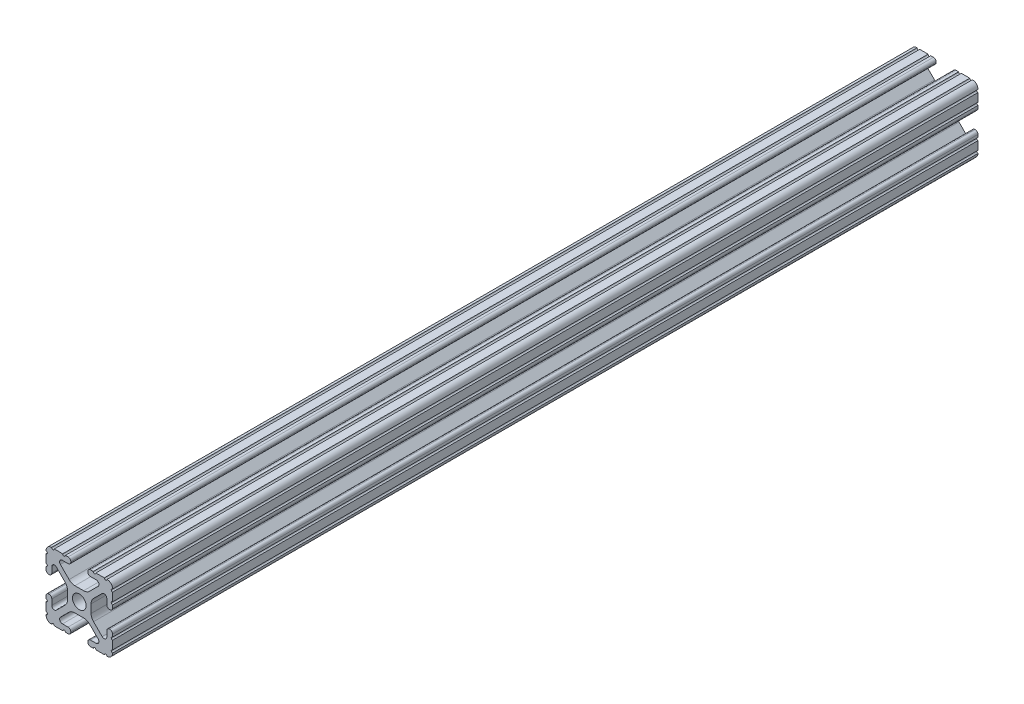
from build123d import *

# Parameters (mm, degrees)
SKETCH1_R           = 2.6035
BOSS_EXTRUDE1_DEPTH = 165.1


with BuildPart() as part:
    # Sketch1 → Boss-Extrude1 (new, symmetric)
    with BuildSketch(Plane.XY):
        with BuildLine():
            Line((-7.179650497, -8.645192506), (-3.952270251, -5.423690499))
            ThreePointArc((-3.952270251, -5.423690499), (-2.922936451, -4.736929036), (-1.709253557, -4.4958))
            Line((-1.709253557, -4.4958), (1.709253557, -4.4958))
            ThreePointArc((1.709253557, -4.4958), (2.922936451, -4.736929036), (3.952270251, -5.423690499))
            Line((3.952270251, -5.423690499), (7.179650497, -8.645192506))
            ThreePointArc((7.179650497, -8.645192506), (7.41473083, -9.822813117), (6.416408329, -10.4902))
            Line((6.416408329, -10.4902), (4.287512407, -10.4902))
            ThreePointArc((4.287512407, -10.4902), (3.54574862, -10.79744862), (3.2385, -11.539212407))
            Line((3.2385, -11.539212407), (3.2385, -11.650987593))
            ThreePointArc((3.2385, -11.650987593), (3.54574862, -12.39275138), (4.287512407, -12.7))
            Line((4.287512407, -12.7), (5.317126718, -12.7))
            ThreePointArc((5.317126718, -12.7), (5.825126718, -12.192), (6.333126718, -12.7))
            Line((6.333126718, -12.7), (9.550443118, -12.7))
            ThreePointArc((9.550443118, -12.7), (10.058366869, -12.192000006), (10.566443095, -12.699847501))
            ThreePointArc((10.566443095, -12.699847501), (12.082537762, -12.08250727), (12.699846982, -10.566399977))
            ThreePointArc((12.699846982, -10.566399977), (12.192000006, -10.058323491), (12.7, -9.5504))
            Line((12.7, -9.5504), (12.7, -6.3330836))
            ThreePointArc((12.7, -6.3330836), (12.192, -5.8250836), (12.7, -5.3170836))
            Line((12.7, -5.3170836), (12.7, -4.287469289))
            ThreePointArc((12.7, -4.287469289), (12.39275138, -3.545705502), (11.650987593, -3.238456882))
            Line((11.650987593, -3.238456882), (11.539212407, -3.238456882))
            ThreePointArc((11.539212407, -3.238456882), (10.79744862, -3.545705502), (10.4902, -4.287469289))
            Line((10.4902, -4.287469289), (10.4902, -6.402089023))
            ThreePointArc((10.4902, -6.402089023), (9.856505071, -7.351067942), (8.737131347, -7.129408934))
            Line((8.737131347, -7.129408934), (5.441005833, -3.840816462))
            ThreePointArc((5.441005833, -3.840816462), (4.750877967, -2.809883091), (4.5085, -1.593185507))
            Line((4.5085, -1.593185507), (4.5085, 1.593185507))
            ThreePointArc((4.5085, 1.593185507), (4.750877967, 2.809883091), (5.441005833, 3.840816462))
            Line((5.441005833, 3.840816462), (8.737131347, 7.129408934))
            ThreePointArc((8.737131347, 7.129408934), (9.856505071, 7.351067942), (10.4902, 6.402089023))
            Line((10.4902, 6.402089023), (10.4902, 4.287469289))
            ThreePointArc((10.4902, 4.287469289), (10.79744862, 3.545705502), (11.539212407, 3.238456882))
            Line((11.539212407, 3.238456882), (11.650987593, 3.238456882))
            ThreePointArc((11.650987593, 3.238456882), (12.39275138, 3.545705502), (12.7, 4.287469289))
            Line((12.7, 4.287469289), (12.7, 5.3170836))
            ThreePointArc((12.7, 5.3170836), (12.192, 5.8250836), (12.7, 6.3330836))
            Line((12.7, 6.3330836), (12.7, 9.5504))
            ThreePointArc((12.7, 9.5504), (12.192000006, 10.058323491), (12.699846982, 10.566399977))
            ThreePointArc((12.699846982, 10.566399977), (12.082537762, 12.08250727), (10.566443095, 12.699847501))
            ThreePointArc((10.566443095, 12.699847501), (10.058366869, 12.192000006), (9.550443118, 12.7))
            Line((9.550443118, 12.7), (6.333126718, 12.7))
            ThreePointArc((6.333126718, 12.7), (5.825126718, 12.192), (5.317126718, 12.7))
            Line((5.317126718, 12.7), (4.287512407, 12.7))
            ThreePointArc((4.287512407, 12.7), (3.54574862, 12.39275138), (3.2385, 11.650987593))
            Line((3.2385, 11.650987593), (3.2385, 11.539212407))
            ThreePointArc((3.2385, 11.539212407), (3.54574862, 10.79744862), (4.287512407, 10.4902))
            Line((4.287512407, 10.4902), (6.476788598, 10.4902))
            ThreePointArc((6.476788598, 10.4902), (7.432222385, 9.85140422), (7.207036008, 8.724370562))
            Line((7.207036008, 8.724370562), (3.898272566, 5.423169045))
            ThreePointArc((3.898272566, 5.423169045), (2.869120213, 4.736787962), (1.655778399, 4.4958))
            Line((1.655778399, 4.4958), (-1.655778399, 4.4958))
            ThreePointArc((-1.655778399, 4.4958), (-2.869120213, 4.736787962), (-3.898272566, 5.423169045))
            Line((-3.898272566, 5.423169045), (-7.207036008, 8.724370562))
            ThreePointArc((-7.207036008, 8.724370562), (-7.432222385, 9.85140422), (-6.476788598, 10.4902))
            Line((-6.476788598, 10.4902), (-4.287512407, 10.4902))
            ThreePointArc((-4.287512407, 10.4902), (-3.54574862, 10.79744862), (-3.2385, 11.539212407))
            Line((-3.2385, 11.539212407), (-3.2385, 11.650987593))
            ThreePointArc((-3.2385, 11.650987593), (-3.54574862, 12.39275138), (-4.287512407, 12.7))
            Line((-4.287512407, 12.7), (-5.317126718, 12.7))
            ThreePointArc((-5.317126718, 12.7), (-5.825126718, 12.192), (-6.333126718, 12.7))
            Line((-6.333126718, 12.7), (-9.550443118, 12.7))
            ThreePointArc((-9.550443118, 12.7), (-10.058366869, 12.192000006), (-10.566443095, 12.699847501))
            ThreePointArc((-10.566443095, 12.699847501), (-12.082537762, 12.08250727), (-12.699846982, 10.566399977))
            ThreePointArc((-12.699846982, 10.566399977), (-12.192000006, 10.058323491), (-12.7, 9.5504))
            Line((-12.7, 9.5504), (-12.7, 6.3330836))
            ThreePointArc((-12.7, 6.3330836), (-12.192, 5.8250836), (-12.7, 5.3170836))
            Line((-12.7, 5.3170836), (-12.7, 4.287469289))
            ThreePointArc((-12.7, 4.287469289), (-12.39275138, 3.545705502), (-11.650987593, 3.238456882))
            Line((-11.650987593, 3.238456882), (-11.539212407, 3.238456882))
            ThreePointArc((-11.539212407, 3.238456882), (-10.79744862, 3.545705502), (-10.4902, 4.287469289))
            Line((-10.4902, 4.287469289), (-10.4902, 6.402089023))
            ThreePointArc((-10.4902, 6.402089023), (-9.856505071, 7.351067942), (-8.737131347, 7.129408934))
            Line((-8.737131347, 7.129408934), (-5.441005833, 3.840816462))
            ThreePointArc((-5.441005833, 3.840816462), (-4.750877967, 2.809883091), (-4.5085, 1.593185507))
            Line((-4.5085, 1.593185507), (-4.5085, -1.593185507))
            ThreePointArc((-4.5085, -1.593185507), (-4.750877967, -2.809883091), (-5.441005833, -3.840816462))
            Line((-5.441005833, -3.840816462), (-8.737131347, -7.129408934))
            ThreePointArc((-8.737131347, -7.129408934), (-9.856505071, -7.351067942), (-10.4902, -6.402089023))
            Line((-10.4902, -6.402089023), (-10.4902, -4.287469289))
            ThreePointArc((-10.4902, -4.287469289), (-10.79744862, -3.545705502), (-11.539212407, -3.238456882))
            Line((-11.539212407, -3.238456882), (-11.650987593, -3.238456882))
            ThreePointArc((-11.650987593, -3.238456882), (-12.39275138, -3.545705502), (-12.7, -4.287469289))
            Line((-12.7, -4.287469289), (-12.7, -5.3170836))
            ThreePointArc((-12.7, -5.3170836), (-12.192, -5.8250836), (-12.7, -6.3330836))
            Line((-12.7, -6.3330836), (-12.7, -9.5504))
            ThreePointArc((-12.7, -9.5504), (-12.192000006, -10.058323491), (-12.699846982, -10.566399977))
            ThreePointArc((-12.699846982, -10.566399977), (-12.082537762, -12.08250727), (-10.566443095, -12.699847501))
            ThreePointArc((-10.566443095, -12.699847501), (-10.058366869, -12.192000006), (-9.550443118, -12.7))
            Line((-9.550443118, -12.7), (-6.333126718, -12.7))
            ThreePointArc((-6.333126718, -12.7), (-5.825126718, -12.192), (-5.317126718, -12.7))
            Line((-5.317126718, -12.7), (-4.287512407, -12.7))
            ThreePointArc((-4.287512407, -12.7), (-3.54574862, -12.39275138), (-3.2385, -11.650987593))
            Line((-3.2385, -11.650987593), (-3.2385, -11.539212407))
            ThreePointArc((-3.2385, -11.539212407), (-3.54574862, -10.79744862), (-4.287512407, -10.4902))
            Line((-4.287512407, -10.4902), (-6.416408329, -10.4902))
            ThreePointArc((-6.416408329, -10.4902), (-7.41473083, -9.822813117), (-7.179650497, -8.645192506))
        make_face()
        Circle(SKETCH1_R, mode=Mode.SUBTRACT)
    extrude(amount=BOSS_EXTRUDE1_DEPTH, both=True)


solid = part.part
